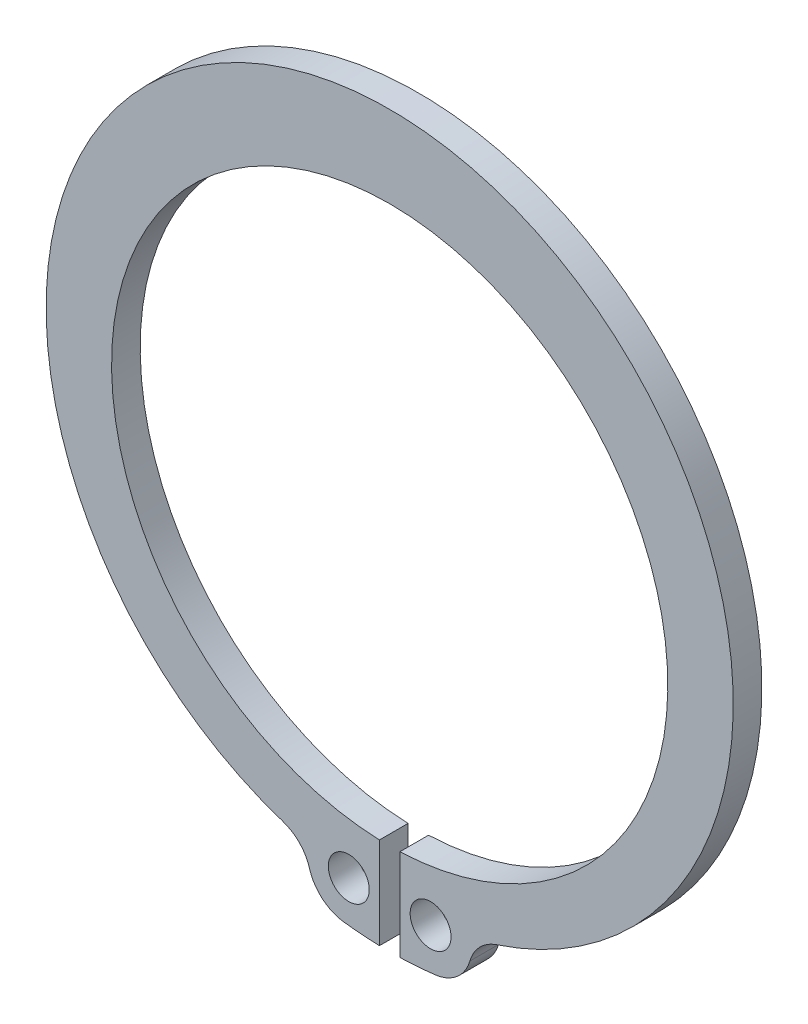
ISO-10303-21;
HEADER;
FILE_DESCRIPTION(('STEP AP214'),'2;1');
FILE_NAME('part.step','',(''),(''),'','','');
FILE_SCHEMA(('AUTOMOTIVE_DESIGN { 1 0 10303 214 1 1 1 1 }'));
ENDSEC;
DATA;
#1=APPLICATION_CONTEXT('core data for automotive mechanical design processes');
#2=APPLICATION_PROTOCOL_DEFINITION('international standard','automotive_design',2000,#1);
#3=PRODUCT_CONTEXT('',#1,'mechanical');
#4=PRODUCT('Part','Part','',(#3));
#5=PRODUCT_RELATED_PRODUCT_CATEGORY('part','',(#4));
#6=PRODUCT_DEFINITION_FORMATION('','',#4);
#7=PRODUCT_DEFINITION_CONTEXT('part definition',#1,'design');
#8=PRODUCT_DEFINITION('design','',#6,#7);
#9=PRODUCT_DEFINITION_SHAPE('','',#8);
#10=(LENGTH_UNIT() NAMED_UNIT(*) SI_UNIT(.MILLI.,.METRE.));
#11=(NAMED_UNIT(*) PLANE_ANGLE_UNIT() SI_UNIT($,.RADIAN.));
#12=(NAMED_UNIT(*) SI_UNIT($,.STERADIAN.) SOLID_ANGLE_UNIT());
#13=UNCERTAINTY_MEASURE_WITH_UNIT(LENGTH_MEASURE(1.E-05),#10,'distance_accuracy_value','');
#14=(GEOMETRIC_REPRESENTATION_CONTEXT(3) GLOBAL_UNCERTAINTY_ASSIGNED_CONTEXT((#13)) GLOBAL_UNIT_ASSIGNED_CONTEXT((#10,
#11,#12)) REPRESENTATION_CONTEXT('',''));
#15=CARTESIAN_POINT('',(0.,0.,0.));
#16=DIRECTION('',(0.,0.,1.));
#17=DIRECTION('',(1.,0.,0.));
#18=AXIS2_PLACEMENT_3D('',#15,#16,#17);
#19=CARTESIAN_POINT('',(0.,-20.1593192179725,1.75));
#20=DIRECTION('',(0.,0.,1.));
#21=DIRECTION('',(1.,0.,0.));
#22=AXIS2_PLACEMENT_3D('',#19,#20,#21);
#23=PLANE('',#22);
#24=CARTESIAN_POINT('',(0.,-17.,1.75));
#25=DIRECTION('',(0.,0.,1.));
#26=DIRECTION('',(1.,0.,0.));
#27=AXIS2_PLACEMENT_3D('',#24,#25,#26);
#28=CIRCLE('',#27,21.);
#29=CARTESIAN_POINT('',(-6.52445072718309,-36.960750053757,1.75));
#30=VERTEX_POINT('',#29);
#31=CARTESIAN_POINT('',(6.52445072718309,-36.960750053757,1.75));
#32=VERTEX_POINT('',#31);
#33=EDGE_CURVE('E159',#30,#32,#28,.F.);
#34=ORIENTED_EDGE('',*,*,#33,.F.);
#35=CARTESIAN_POINT('',(-7.30117105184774,-39.3370298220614,1.75));
#36=DIRECTION('',(0.,0.,1.));
#37=DIRECTION('',(1.,0.,0.));
#38=AXIS2_PLACEMENT_3D('',#35,#36,#37);
#39=CIRCLE('',#38,2.5);
#40=CARTESIAN_POINT('',(-4.90058552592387,-38.6390404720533,1.75));
#41=VERTEX_POINT('',#40);
#42=EDGE_CURVE('E156',#41,#30,#39,.T.);
#43=ORIENTED_EDGE('',*,*,#42,.F.);
#44=CARTESIAN_POINT('',(-2.5,-37.9410511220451,1.75));
#45=DIRECTION('',(0.,0.,1.));
#46=DIRECTION('',(1.,0.,0.));
#47=AXIS2_PLACEMENT_3D('',#44,#45,#46);
#48=CIRCLE('',#47,2.5);
#49=CARTESIAN_POINT('',(-2.81098933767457,-40.4216328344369,1.75));
#50=VERTEX_POINT('',#49);
#51=EDGE_CURVE('E153',#50,#41,#48,.F.);
#52=ORIENTED_EDGE('',*,*,#51,.F.);
#53=CARTESIAN_POINT('',(0.,-18.,1.75));
#54=DIRECTION('',(0.,0.,1.));
#55=DIRECTION('',(1.,0.,0.));
#56=AXIS2_PLACEMENT_3D('',#53,#54,#55);
#57=CIRCLE('',#56,22.5971520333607);
#58=CARTESIAN_POINT('',(-0.624999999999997,-40.5885071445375,1.75));
#59=VERTEX_POINT('',#58);
#60=EDGE_CURVE('E109',#59,#50,#57,.F.);
#61=ORIENTED_EDGE('',*,*,#60,.F.);
#62=DIRECTION('',(0.,1.,0.));
#63=VECTOR('',#62,1.);
#64=CARTESIAN_POINT('',(-0.624999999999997,-34.9885071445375,1.75));
#65=LINE('',#64,#63);
#66=CARTESIAN_POINT('',(-0.624999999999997,-34.9885071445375,1.75));
#67=VERTEX_POINT('',#66);
#68=EDGE_CURVE('E103',#67,#59,#65,.F.);
#69=ORIENTED_EDGE('',*,*,#68,.F.);
#70=CARTESIAN_POINT('',(0.,-18.,1.75));
#71=DIRECTION('',(0.,0.,1.));
#72=DIRECTION('',(1.,0.,0.));
#73=AXIS2_PLACEMENT_3D('',#70,#71,#72);
#74=CIRCLE('',#73,17.);
#75=CARTESIAN_POINT('',(0.624999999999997,-34.9885071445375,1.75));
#76=VERTEX_POINT('',#75);
#77=EDGE_CURVE('E94',#76,#67,#74,.T.);
#78=ORIENTED_EDGE('',*,*,#77,.F.);
#79=DIRECTION('',(0.,-1.,0.));
#80=VECTOR('',#79,1.);
#81=CARTESIAN_POINT('',(0.624999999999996,-40.5885071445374,1.75));
#82=LINE('',#81,#80);
#83=CARTESIAN_POINT('',(0.624999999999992,-40.5885071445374,1.75));
#84=VERTEX_POINT('',#83);
#85=EDGE_CURVE('E89',#84,#76,#82,.F.);
#86=ORIENTED_EDGE('',*,*,#85,.F.);
#87=CARTESIAN_POINT('',(0.,-18.,1.75));
#88=DIRECTION('',(0.,0.,1.));
#89=DIRECTION('',(1.,0.,0.));
#90=AXIS2_PLACEMENT_3D('',#87,#88,#89);
#91=CIRCLE('',#90,22.5971520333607);
#92=CARTESIAN_POINT('',(2.81098933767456,-40.4216328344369,1.75));
#93=VERTEX_POINT('',#92);
#94=EDGE_CURVE('E168',#93,#84,#91,.F.);
#95=ORIENTED_EDGE('',*,*,#94,.F.);
#96=CARTESIAN_POINT('',(2.5,-37.9410511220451,1.75));
#97=DIRECTION('',(0.,0.,1.));
#98=DIRECTION('',(1.,0.,0.));
#99=AXIS2_PLACEMENT_3D('',#96,#97,#98);
#100=CIRCLE('',#99,2.5);
#101=CARTESIAN_POINT('',(4.90058552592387,-38.6390404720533,1.75));
#102=VERTEX_POINT('',#101);
#103=EDGE_CURVE('E165',#102,#93,#100,.F.);
#104=ORIENTED_EDGE('',*,*,#103,.F.);
#105=CARTESIAN_POINT('',(7.30117105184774,-39.3370298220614,1.75));
#106=DIRECTION('',(0.,0.,1.));
#107=DIRECTION('',(1.,0.,0.));
#108=AXIS2_PLACEMENT_3D('',#105,#106,#107);
#109=CIRCLE('',#108,2.5);
#110=EDGE_CURVE('E162',#32,#102,#109,.T.);
#111=ORIENTED_EDGE('',*,*,#110,.F.);
#112=EDGE_LOOP('',(#34,#43,#52,#61,#69,#78,#86,#95,#104,#111));
#113=FACE_BOUND('',#112,.T.);
#114=CARTESIAN_POINT('',(-2.5,-37.9410511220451,1.75));
#115=DIRECTION('',(0.,0.,1.));
#116=DIRECTION('',(1.,0.,0.));
#117=AXIS2_PLACEMENT_3D('',#114,#115,#116);
#118=CIRCLE('',#117,1.25);
#119=CARTESIAN_POINT('',(-1.25,-37.9410511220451,1.75));
#120=VERTEX_POINT('',#119);
#121=EDGE_CURVE('E113',#120,#120,#118,.F.);
#122=ORIENTED_EDGE('',*,*,#121,.T.);
#123=EDGE_LOOP('',(#122));
#124=FACE_BOUND('',#123,.T.);
#125=CARTESIAN_POINT('',(2.5,-37.9410511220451,1.75));
#126=DIRECTION('',(0.,0.,1.));
#127=DIRECTION('',(1.,0.,0.));
#128=AXIS2_PLACEMENT_3D('',#125,#126,#127);
#129=CIRCLE('',#128,1.25);
#130=CARTESIAN_POINT('',(3.75,-37.9410511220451,1.75));
#131=VERTEX_POINT('',#130);
#132=EDGE_CURVE('E20',#131,#131,#129,.F.);
#133=ORIENTED_EDGE('',*,*,#132,.T.);
#134=EDGE_LOOP('',(#133));
#135=FACE_BOUND('',#134,.T.);
#136=ADVANCED_FACE('F16',(#113,#124,#135),#23,.T.);
#137=CARTESIAN_POINT('',(2.5,-37.9410511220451,0.));
#138=DIRECTION('',(0.,0.,1.));
#139=DIRECTION('',(1.,0.,0.));
#140=AXIS2_PLACEMENT_3D('',#137,#138,#139);
#141=CYLINDRICAL_SURFACE('',#140,1.25);
#142=CARTESIAN_POINT('',(2.5,-37.9410511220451,0.));
#143=DIRECTION('',(0.,0.,1.));
#144=DIRECTION('',(1.,0.,0.));
#145=AXIS2_PLACEMENT_3D('',#142,#143,#144);
#146=CIRCLE('',#145,1.25);
#147=CARTESIAN_POINT('',(3.75,-37.9410511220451,0.));
#148=VERTEX_POINT('',#147);
#149=EDGE_CURVE('E147',#148,#148,#146,.F.);
#150=ORIENTED_EDGE('',*,*,#149,.T.);
#151=EDGE_LOOP('',(#150));
#152=FACE_BOUND('',#151,.T.);
#153=ORIENTED_EDGE('',*,*,#132,.F.);
#154=EDGE_LOOP('',(#153));
#155=FACE_BOUND('',#154,.T.);
#156=ADVANCED_FACE('F175',(#152,#155),#141,.F.);
#157=CARTESIAN_POINT('',(-2.5,-37.9410511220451,0.));
#158=DIRECTION('',(0.,0.,1.));
#159=DIRECTION('',(1.,0.,0.));
#160=AXIS2_PLACEMENT_3D('',#157,#158,#159);
#161=CYLINDRICAL_SURFACE('',#160,1.25);
#162=CARTESIAN_POINT('',(-2.5,-37.9410511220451,0.));
#163=DIRECTION('',(0.,0.,1.));
#164=DIRECTION('',(1.,0.,0.));
#165=AXIS2_PLACEMENT_3D('',#162,#163,#164);
#166=CIRCLE('',#165,1.25);
#167=CARTESIAN_POINT('',(-1.25,-37.9410511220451,0.));
#168=VERTEX_POINT('',#167);
#169=EDGE_CURVE('E144',#168,#168,#166,.F.);
#170=ORIENTED_EDGE('',*,*,#169,.T.);
#171=EDGE_LOOP('',(#170));
#172=FACE_BOUND('',#171,.T.);
#173=ORIENTED_EDGE('',*,*,#121,.F.);
#174=EDGE_LOOP('',(#173));
#175=FACE_BOUND('',#174,.T.);
#176=ADVANCED_FACE('F177',(#172,#175),#161,.F.);
#177=CARTESIAN_POINT('',(-0.624999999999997,-34.9885071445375,0.));
#178=DIRECTION('',(1.,0.,0.));
#179=DIRECTION('',(0.,0.,-1.));
#180=AXIS2_PLACEMENT_3D('',#177,#178,#179);
#181=PLANE('',#180);
#182=DIRECTION('',(0.,1.,0.));
#183=VECTOR('',#182,1.);
#184=CARTESIAN_POINT('',(-0.624999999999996,-20.1593192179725,0.));
#185=LINE('',#184,#183);
#186=CARTESIAN_POINT('',(-0.624999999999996,-40.5885071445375,0.));
#187=VERTEX_POINT('',#186);
#188=CARTESIAN_POINT('',(-0.624999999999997,-34.9885071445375,0.));
#189=VERTEX_POINT('',#188);
#190=EDGE_CURVE('E118',#187,#189,#185,.T.);
#191=ORIENTED_EDGE('',*,*,#190,.T.);
#192=DIRECTION('',(0.,0.,1.));
#193=VECTOR('',#192,1.);
#194=CARTESIAN_POINT('',(-0.624999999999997,-34.9885071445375,0.));
#195=LINE('',#194,#193);
#196=EDGE_CURVE('E99',#67,#189,#195,.F.);
#197=ORIENTED_EDGE('',*,*,#196,.F.);
#198=ORIENTED_EDGE('',*,*,#68,.T.);
#199=DIRECTION('',(0.,0.,1.));
#200=VECTOR('',#199,1.);
#201=CARTESIAN_POINT('',(-0.624999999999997,-40.5885071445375,0.));
#202=LINE('',#201,#200);
#203=EDGE_CURVE('E150',#187,#59,#202,.T.);
#204=ORIENTED_EDGE('',*,*,#203,.F.);
#205=EDGE_LOOP('',(#191,#197,#198,#204));
#206=FACE_BOUND('',#205,.T.);
#207=ADVANCED_FACE('F116',(#206),#181,.T.);
#208=CARTESIAN_POINT('',(0.,-18.,0.));
#209=DIRECTION('',(0.,0.,1.));
#210=DIRECTION('',(1.,0.,0.));
#211=AXIS2_PLACEMENT_3D('',#208,#209,#210);
#212=CYLINDRICAL_SURFACE('',#211,17.);
#213=CARTESIAN_POINT('',(0.,-18.,0.));
#214=DIRECTION('',(0.,0.,1.));
#215=DIRECTION('',(1.,0.,0.));
#216=AXIS2_PLACEMENT_3D('',#213,#214,#215);
#217=CIRCLE('',#216,17.);
#218=CARTESIAN_POINT('',(0.624999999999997,-34.9885071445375,0.));
#219=VERTEX_POINT('',#218);
#220=EDGE_CURVE('E142',#189,#219,#217,.F.);
#221=ORIENTED_EDGE('',*,*,#220,.T.);
#222=DIRECTION('',(0.,0.,1.));
#223=VECTOR('',#222,1.);
#224=CARTESIAN_POINT('',(0.624999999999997,-34.9885071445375,0.));
#225=LINE('',#224,#223);
#226=EDGE_CURVE('E101',#76,#219,#225,.F.);
#227=ORIENTED_EDGE('',*,*,#226,.F.);
#228=ORIENTED_EDGE('',*,*,#77,.T.);
#229=ORIENTED_EDGE('',*,*,#196,.T.);
#230=EDGE_LOOP('',(#221,#227,#228,#229));
#231=FACE_BOUND('',#230,.T.);
#232=ADVANCED_FACE('F97',(#231),#212,.F.);
#233=CARTESIAN_POINT('',(0.624999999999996,-40.5885071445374,0.));
#234=DIRECTION('',(-1.,0.,0.));
#235=DIRECTION('',(0.,-1.,0.));
#236=AXIS2_PLACEMENT_3D('',#233,#234,#235);
#237=PLANE('',#236);
#238=DIRECTION('',(0.,1.,0.));
#239=VECTOR('',#238,1.);
#240=CARTESIAN_POINT('',(0.624999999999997,-20.1593192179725,0.));
#241=LINE('',#240,#239);
#242=CARTESIAN_POINT('',(0.624999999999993,-40.5885071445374,0.));
#243=VERTEX_POINT('',#242);
#244=EDGE_CURVE('E141',#219,#243,#241,.F.);
#245=ORIENTED_EDGE('',*,*,#244,.T.);
#246=DIRECTION('',(0.,0.,1.));
#247=VECTOR('',#246,1.);
#248=CARTESIAN_POINT('',(0.624999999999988,-40.5885071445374,0.));
#249=LINE('',#248,#247);
#250=EDGE_CURVE('E167',#84,#243,#249,.F.);
#251=ORIENTED_EDGE('',*,*,#250,.F.);
#252=ORIENTED_EDGE('',*,*,#85,.T.);
#253=ORIENTED_EDGE('',*,*,#226,.T.);
#254=EDGE_LOOP('',(#245,#251,#252,#253));
#255=FACE_BOUND('',#254,.T.);
#256=ADVANCED_FACE('F223',(#255),#237,.T.);
#257=CARTESIAN_POINT('',(0.,-18.,0.));
#258=DIRECTION('',(0.,0.,1.));
#259=DIRECTION('',(1.,0.,0.));
#260=AXIS2_PLACEMENT_3D('',#257,#258,#259);
#261=CYLINDRICAL_SURFACE('',#260,22.5971520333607);
#262=CARTESIAN_POINT('',(0.,-18.,0.));
#263=DIRECTION('',(0.,0.,1.));
#264=DIRECTION('',(1.,0.,0.));
#265=AXIS2_PLACEMENT_3D('',#262,#263,#264);
#266=CIRCLE('',#265,22.5971520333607);
#267=CARTESIAN_POINT('',(2.81098933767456,-40.4216328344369,0.));
#268=VERTEX_POINT('',#267);
#269=EDGE_CURVE('E138',#243,#268,#266,.T.);
#270=ORIENTED_EDGE('',*,*,#269,.T.);
#271=DIRECTION('',(0.,0.,1.));
#272=VECTOR('',#271,1.);
#273=CARTESIAN_POINT('',(2.81098933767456,-40.4216328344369,0.));
#274=LINE('',#273,#272);
#275=EDGE_CURVE('E164',#93,#268,#274,.F.);
#276=ORIENTED_EDGE('',*,*,#275,.F.);
#277=ORIENTED_EDGE('',*,*,#94,.T.);
#278=ORIENTED_EDGE('',*,*,#250,.T.);
#279=EDGE_LOOP('',(#270,#276,#277,#278));
#280=FACE_BOUND('',#279,.T.);
#281=ADVANCED_FACE('F216',(#280),#261,.T.);
#282=CARTESIAN_POINT('',(2.5,-37.9410511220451,0.));
#283=DIRECTION('',(0.,0.,1.));
#284=DIRECTION('',(1.,0.,0.));
#285=AXIS2_PLACEMENT_3D('',#282,#283,#284);
#286=CYLINDRICAL_SURFACE('',#285,2.5);
#287=CARTESIAN_POINT('',(2.5,-37.9410511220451,0.));
#288=DIRECTION('',(0.,0.,1.));
#289=DIRECTION('',(1.,0.,0.));
#290=AXIS2_PLACEMENT_3D('',#287,#288,#289);
#291=CIRCLE('',#290,2.5);
#292=CARTESIAN_POINT('',(4.90058552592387,-38.6390404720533,0.));
#293=VERTEX_POINT('',#292);
#294=EDGE_CURVE('E135',#268,#293,#291,.T.);
#295=ORIENTED_EDGE('',*,*,#294,.T.);
#296=DIRECTION('',(0.,0.,1.));
#297=VECTOR('',#296,1.);
#298=CARTESIAN_POINT('',(4.90058552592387,-38.6390404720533,0.));
#299=LINE('',#298,#297);
#300=EDGE_CURVE('E161',#102,#293,#299,.F.);
#301=ORIENTED_EDGE('',*,*,#300,.F.);
#302=ORIENTED_EDGE('',*,*,#103,.T.);
#303=ORIENTED_EDGE('',*,*,#275,.T.);
#304=EDGE_LOOP('',(#295,#301,#302,#303));
#305=FACE_BOUND('',#304,.T.);
#306=ADVANCED_FACE('F239',(#305),#286,.T.);
#307=CARTESIAN_POINT('',(7.30117105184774,-39.3370298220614,0.));
#308=DIRECTION('',(0.,0.,1.));
#309=DIRECTION('',(1.,0.,0.));
#310=AXIS2_PLACEMENT_3D('',#307,#308,#309);
#311=CYLINDRICAL_SURFACE('',#310,2.5);
#312=CARTESIAN_POINT('',(7.30117105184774,-39.3370298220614,0.));
#313=DIRECTION('',(0.,0.,1.));
#314=DIRECTION('',(1.,0.,0.));
#315=AXIS2_PLACEMENT_3D('',#312,#313,#314);
#316=CIRCLE('',#315,2.5);
#317=CARTESIAN_POINT('',(6.52445072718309,-36.960750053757,0.));
#318=VERTEX_POINT('',#317);
#319=EDGE_CURVE('E132',#293,#318,#316,.F.);
#320=ORIENTED_EDGE('',*,*,#319,.T.);
#321=DIRECTION('',(0.,0.,1.));
#322=VECTOR('',#321,1.);
#323=CARTESIAN_POINT('',(6.52445072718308,-36.960750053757,0.));
#324=LINE('',#323,#322);
#325=EDGE_CURVE('E158',#32,#318,#324,.F.);
#326=ORIENTED_EDGE('',*,*,#325,.F.);
#327=ORIENTED_EDGE('',*,*,#110,.T.);
#328=ORIENTED_EDGE('',*,*,#300,.T.);
#329=EDGE_LOOP('',(#320,#326,#327,#328));
#330=FACE_BOUND('',#329,.T.);
#331=ADVANCED_FACE('F236',(#330),#311,.F.);
#332=CARTESIAN_POINT('',(0.,-17.,0.));
#333=DIRECTION('',(0.,0.,1.));
#334=DIRECTION('',(1.,0.,0.));
#335=AXIS2_PLACEMENT_3D('',#332,#333,#334);
#336=CYLINDRICAL_SURFACE('',#335,21.);
#337=CARTESIAN_POINT('',(0.,-17.,0.));
#338=DIRECTION('',(0.,0.,1.));
#339=DIRECTION('',(1.,0.,0.));
#340=AXIS2_PLACEMENT_3D('',#337,#338,#339);
#341=CIRCLE('',#340,21.);
#342=CARTESIAN_POINT('',(-6.52445072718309,-36.960750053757,0.));
#343=VERTEX_POINT('',#342);
#344=EDGE_CURVE('E129',#318,#343,#341,.T.);
#345=ORIENTED_EDGE('',*,*,#344,.T.);
#346=DIRECTION('',(0.,0.,1.));
#347=VECTOR('',#346,1.);
#348=CARTESIAN_POINT('',(-6.52445072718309,-36.960750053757,0.));
#349=LINE('',#348,#347);
#350=EDGE_CURVE('E155',#30,#343,#349,.F.);
#351=ORIENTED_EDGE('',*,*,#350,.F.);
#352=ORIENTED_EDGE('',*,*,#33,.T.);
#353=ORIENTED_EDGE('',*,*,#325,.T.);
#354=EDGE_LOOP('',(#345,#351,#352,#353));
#355=FACE_BOUND('',#354,.T.);
#356=ADVANCED_FACE('F231',(#355),#336,.T.);
#357=CARTESIAN_POINT('',(-7.30117105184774,-39.3370298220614,0.));
#358=DIRECTION('',(0.,0.,1.));
#359=DIRECTION('',(1.,0.,0.));
#360=AXIS2_PLACEMENT_3D('',#357,#358,#359);
#361=CYLINDRICAL_SURFACE('',#360,2.5);
#362=CARTESIAN_POINT('',(-7.30117105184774,-39.3370298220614,0.));
#363=DIRECTION('',(0.,0.,1.));
#364=DIRECTION('',(1.,0.,0.));
#365=AXIS2_PLACEMENT_3D('',#362,#363,#364);
#366=CIRCLE('',#365,2.5);
#367=CARTESIAN_POINT('',(-4.90058552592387,-38.6390404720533,0.));
#368=VERTEX_POINT('',#367);
#369=EDGE_CURVE('E126',#343,#368,#366,.F.);
#370=ORIENTED_EDGE('',*,*,#369,.T.);
#371=DIRECTION('',(0.,0.,1.));
#372=VECTOR('',#371,1.);
#373=CARTESIAN_POINT('',(-4.90058552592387,-38.6390404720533,0.));
#374=LINE('',#373,#372);
#375=EDGE_CURVE('E152',#41,#368,#374,.F.);
#376=ORIENTED_EDGE('',*,*,#375,.F.);
#377=ORIENTED_EDGE('',*,*,#42,.T.);
#378=ORIENTED_EDGE('',*,*,#350,.T.);
#379=EDGE_LOOP('',(#370,#376,#377,#378));
#380=FACE_BOUND('',#379,.T.);
#381=ADVANCED_FACE('F204',(#380),#361,.F.);
#382=CARTESIAN_POINT('',(-2.5,-37.9410511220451,0.));
#383=DIRECTION('',(0.,0.,1.));
#384=DIRECTION('',(1.,0.,0.));
#385=AXIS2_PLACEMENT_3D('',#382,#383,#384);
#386=CYLINDRICAL_SURFACE('',#385,2.5);
#387=CARTESIAN_POINT('',(-2.5,-37.9410511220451,0.));
#388=DIRECTION('',(0.,0.,1.));
#389=DIRECTION('',(1.,0.,0.));
#390=AXIS2_PLACEMENT_3D('',#387,#388,#389);
#391=CIRCLE('',#390,2.5);
#392=CARTESIAN_POINT('',(-2.81098933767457,-40.4216328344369,0.));
#393=VERTEX_POINT('',#392);
#394=EDGE_CURVE('E26',#368,#393,#391,.T.);
#395=ORIENTED_EDGE('',*,*,#394,.T.);
#396=DIRECTION('',(0.,0.,1.));
#397=VECTOR('',#396,1.);
#398=CARTESIAN_POINT('',(-2.81098933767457,-40.4216328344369,0.));
#399=LINE('',#398,#397);
#400=EDGE_CURVE('E34',#50,#393,#399,.F.);
#401=ORIENTED_EDGE('',*,*,#400,.F.);
#402=ORIENTED_EDGE('',*,*,#51,.T.);
#403=ORIENTED_EDGE('',*,*,#375,.T.);
#404=EDGE_LOOP('',(#395,#401,#402,#403));
#405=FACE_BOUND('',#404,.T.);
#406=ADVANCED_FACE('F192',(#405),#386,.T.);
#407=CARTESIAN_POINT('',(0.,-18.,0.));
#408=DIRECTION('',(0.,0.,1.));
#409=DIRECTION('',(1.,0.,0.));
#410=AXIS2_PLACEMENT_3D('',#407,#408,#409);
#411=CYLINDRICAL_SURFACE('',#410,22.5971520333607);
#412=CARTESIAN_POINT('',(0.,-18.,0.));
#413=DIRECTION('',(0.,0.,1.));
#414=DIRECTION('',(1.,0.,0.));
#415=AXIS2_PLACEMENT_3D('',#412,#413,#414);
#416=CIRCLE('',#415,22.5971520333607);
#417=EDGE_CURVE('E10',#393,#187,#416,.T.);
#418=ORIENTED_EDGE('',*,*,#417,.T.);
#419=ORIENTED_EDGE('',*,*,#203,.T.);
#420=ORIENTED_EDGE('',*,*,#60,.T.);
#421=ORIENTED_EDGE('',*,*,#400,.T.);
#422=EDGE_LOOP('',(#418,#419,#420,#421));
#423=FACE_BOUND('',#422,.T.);
#424=ADVANCED_FACE('F188',(#423),#411,.T.);
#425=CARTESIAN_POINT('',(0.,-20.1593192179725,0.));
#426=DIRECTION('',(0.,0.,1.));
#427=DIRECTION('',(1.,0.,0.));
#428=AXIS2_PLACEMENT_3D('',#425,#426,#427);
#429=PLANE('',#428);
#430=ORIENTED_EDGE('',*,*,#394,.F.);
#431=ORIENTED_EDGE('',*,*,#369,.F.);
#432=ORIENTED_EDGE('',*,*,#344,.F.);
#433=ORIENTED_EDGE('',*,*,#319,.F.);
#434=ORIENTED_EDGE('',*,*,#294,.F.);
#435=ORIENTED_EDGE('',*,*,#269,.F.);
#436=ORIENTED_EDGE('',*,*,#244,.F.);
#437=ORIENTED_EDGE('',*,*,#220,.F.);
#438=ORIENTED_EDGE('',*,*,#190,.F.);
#439=ORIENTED_EDGE('',*,*,#417,.F.);
#440=EDGE_LOOP('',(#430,#431,#432,#433,#434,#435,#436,#437,#438,#439));
#441=FACE_BOUND('',#440,.T.);
#442=ORIENTED_EDGE('',*,*,#169,.F.);
#443=EDGE_LOOP('',(#442));
#444=FACE_BOUND('',#443,.T.);
#445=ORIENTED_EDGE('',*,*,#149,.F.);
#446=EDGE_LOOP('',(#445));
#447=FACE_BOUND('',#446,.T.);
#448=ADVANCED_FACE('F18',(#441,#444,#447),#429,.F.);
#449=CLOSED_SHELL('',(#136,#156,#176,#207,#232,#256,#281,#306,#331,#356,#381,#406,#424,#448));
#450=MANIFOLD_SOLID_BREP('B1',#449);
#451=ADVANCED_BREP_SHAPE_REPRESENTATION('',(#18,#450),#14);
#452=SHAPE_DEFINITION_REPRESENTATION(#9,#451);
ENDSEC;
END-ISO-10303-21;
